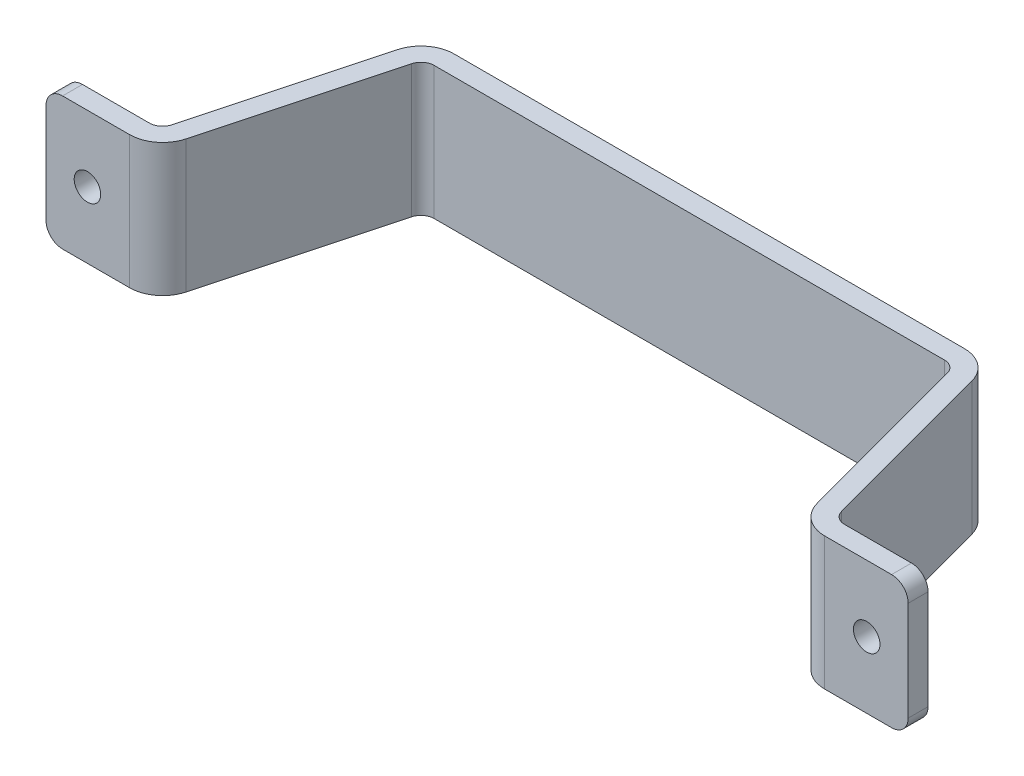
ISO-10303-21;
HEADER;
FILE_DESCRIPTION(('STEP AP214'),'2;1');
FILE_NAME('part.step','',(''),(''),'','','');
FILE_SCHEMA(('AUTOMOTIVE_DESIGN { 1 0 10303 214 1 1 1 1 }'));
ENDSEC;
DATA;
#1=APPLICATION_CONTEXT('core data for automotive mechanical design processes');
#2=APPLICATION_PROTOCOL_DEFINITION('international standard','automotive_design',2000,#1);
#3=PRODUCT_CONTEXT('',#1,'mechanical');
#4=PRODUCT('Part','Part','',(#3));
#5=PRODUCT_RELATED_PRODUCT_CATEGORY('part','',(#4));
#6=PRODUCT_DEFINITION_FORMATION('','',#4);
#7=PRODUCT_DEFINITION_CONTEXT('part definition',#1,'design');
#8=PRODUCT_DEFINITION('design','',#6,#7);
#9=PRODUCT_DEFINITION_SHAPE('','',#8);
#10=(LENGTH_UNIT() NAMED_UNIT(*) SI_UNIT(.MILLI.,.METRE.));
#11=(NAMED_UNIT(*) PLANE_ANGLE_UNIT() SI_UNIT($,.RADIAN.));
#12=(NAMED_UNIT(*) SI_UNIT($,.STERADIAN.) SOLID_ANGLE_UNIT());
#13=UNCERTAINTY_MEASURE_WITH_UNIT(LENGTH_MEASURE(1.E-05),#10,'distance_accuracy_value','');
#14=(GEOMETRIC_REPRESENTATION_CONTEXT(3) GLOBAL_UNCERTAINTY_ASSIGNED_CONTEXT((#13)) GLOBAL_UNIT_ASSIGNED_CONTEXT((#10,
#11,#12)) REPRESENTATION_CONTEXT('',''));
#15=CARTESIAN_POINT('',(0.,0.,0.));
#16=DIRECTION('',(0.,0.,1.));
#17=DIRECTION('',(1.,0.,0.));
#18=AXIS2_PLACEMENT_3D('',#15,#16,#17);
#19=CARTESIAN_POINT('',(12.5,15.,-3.00000000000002));
#20=DIRECTION('',(1.,0.,0.));
#21=DIRECTION('',(0.,0.,-1.));
#22=AXIS2_PLACEMENT_3D('',#19,#20,#21);
#23=PLANE('',#22);
#24=DIRECTION('',(0.,0.,-1.));
#25=VECTOR('',#24,1.);
#26=CARTESIAN_POINT('',(12.5,15.,-21.8590083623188));
#27=LINE('',#26,#25);
#28=CARTESIAN_POINT('',(12.5,15.,0.));
#29=VERTEX_POINT('',#28);
#30=CARTESIAN_POINT('',(12.5,15.,-6.00000000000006));
#31=VERTEX_POINT('',#30);
#32=EDGE_CURVE('E96',#29,#31,#27,.T.);
#33=ORIENTED_EDGE('',*,*,#32,.F.);
#34=DIRECTION('',(0.,1.,0.));
#35=VECTOR('',#34,1.);
#36=CARTESIAN_POINT('',(12.5,0.,0.));
#37=LINE('',#36,#35);
#38=CARTESIAN_POINT('',(12.5,-15.,0.));
#39=VERTEX_POINT('',#38);
#40=EDGE_CURVE('E214',#39,#29,#37,.T.);
#41=ORIENTED_EDGE('',*,*,#40,.F.);
#42=DIRECTION('',(0.,0.,-1.));
#43=VECTOR('',#42,1.);
#44=CARTESIAN_POINT('',(12.5,-15.,-21.8590083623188));
#45=LINE('',#44,#43);
#46=CARTESIAN_POINT('',(12.5,-15.,-6.00000000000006));
#47=VERTEX_POINT('',#46);
#48=EDGE_CURVE('E67',#47,#39,#45,.F.);
#49=ORIENTED_EDGE('',*,*,#48,.F.);
#50=DIRECTION('',(0.,1.,0.));
#51=VECTOR('',#50,1.);
#52=CARTESIAN_POINT('',(12.5,0.,-6.00000000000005));
#53=LINE('',#52,#51);
#54=EDGE_CURVE('E197',#31,#47,#53,.F.);
#55=ORIENTED_EDGE('',*,*,#54,.F.);
#56=EDGE_LOOP('',(#33,#41,#49,#55));
#57=FACE_BOUND('',#56,.T.);
#58=ADVANCED_FACE('F15',(#57),#23,.T.);
#59=CARTESIAN_POINT('',(0.,0.,-3.00000000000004));
#60=DIRECTION('',(0.,0.,1.));
#61=DIRECTION('',(0.,-1.,0.));
#62=AXIS2_PLACEMENT_3D('',#59,#60,#61);
#63=CYLINDRICAL_SURFACE('',#62,4.);
#64=CARTESIAN_POINT('',(0.,0.,0.));
#65=DIRECTION('',(0.,0.,1.));
#66=DIRECTION('',(0.,-1.,0.));
#67=AXIS2_PLACEMENT_3D('',#64,#65,#66);
#68=CIRCLE('',#67,4.);
#69=CARTESIAN_POINT('',(0.,-3.99999999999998,0.));
#70=VERTEX_POINT('',#69);
#71=EDGE_CURVE('E206',#70,#70,#68,.F.);
#72=ORIENTED_EDGE('',*,*,#71,.F.);
#73=EDGE_LOOP('',(#72));
#74=FACE_BOUND('',#73,.T.);
#75=CARTESIAN_POINT('',(0.,0.,-6.00000000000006));
#76=DIRECTION('',(0.,0.,1.));
#77=DIRECTION('',(0.,-1.,0.));
#78=AXIS2_PLACEMENT_3D('',#75,#76,#77);
#79=CIRCLE('',#78,4.);
#80=CARTESIAN_POINT('',(0.,-3.99999999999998,-6.00000000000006));
#81=VERTEX_POINT('',#80);
#82=EDGE_CURVE('E192',#81,#81,#79,.T.);
#83=ORIENTED_EDGE('',*,*,#82,.F.);
#84=EDGE_LOOP('',(#83));
#85=FACE_BOUND('',#84,.T.);
#86=ADVANCED_FACE('F715',(#74,#85),#63,.F.);
#87=CARTESIAN_POINT('',(-247.5,-20.0000000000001,0.));
#88=DIRECTION('',(-1.,0.,0.));
#89=DIRECTION('',(0.,0.,1.));
#90=AXIS2_PLACEMENT_3D('',#87,#88,#89);
#91=PLANE('',#90);
#92=DIRECTION('',(0.,0.,-1.));
#93=VECTOR('',#92,1.);
#94=CARTESIAN_POINT('',(-247.5,15.,-21.8590083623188));
#95=LINE('',#94,#93);
#96=CARTESIAN_POINT('',(-247.5,15.,-6.00000000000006));
#97=VERTEX_POINT('',#96);
#98=CARTESIAN_POINT('',(-247.5,15.,0.));
#99=VERTEX_POINT('',#98);
#100=EDGE_CURVE('E66',#97,#99,#95,.F.);
#101=ORIENTED_EDGE('',*,*,#100,.F.);
#102=DIRECTION('',(0.,1.,0.));
#103=VECTOR('',#102,1.);
#104=CARTESIAN_POINT('',(-247.5,-20.0000000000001,-6.00000000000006));
#105=LINE('',#104,#103);
#106=CARTESIAN_POINT('',(-247.5,-15.,-6.00000000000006));
#107=VERTEX_POINT('',#106);
#108=EDGE_CURVE('E62',#107,#97,#105,.T.);
#109=ORIENTED_EDGE('',*,*,#108,.F.);
#110=DIRECTION('',(0.,0.,-1.));
#111=VECTOR('',#110,1.);
#112=CARTESIAN_POINT('',(-247.5,-15.,-21.8590083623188));
#113=LINE('',#112,#111);
#114=CARTESIAN_POINT('',(-247.5,-15.,0.));
#115=VERTEX_POINT('',#114);
#116=EDGE_CURVE('E53',#115,#107,#113,.T.);
#117=ORIENTED_EDGE('',*,*,#116,.F.);
#118=DIRECTION('',(0.,1.,0.));
#119=VECTOR('',#118,1.);
#120=CARTESIAN_POINT('',(-247.5,-20.0000000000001,0.));
#121=LINE('',#120,#119);
#122=EDGE_CURVE('E58',#99,#115,#121,.F.);
#123=ORIENTED_EDGE('',*,*,#122,.F.);
#124=EDGE_LOOP('',(#101,#109,#117,#123));
#125=FACE_BOUND('',#124,.T.);
#126=ADVANCED_FACE('F56',(#125),#91,.T.);
#127=CARTESIAN_POINT('',(-235.,0.,86.4868739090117));
#128=DIRECTION('',(0.,0.,-1.));
#129=DIRECTION('',(-1.,0.,0.));
#130=AXIS2_PLACEMENT_3D('',#127,#128,#129);
#131=CYLINDRICAL_SURFACE('',#130,4.);
#132=CARTESIAN_POINT('',(-235.,0.,0.));
#133=DIRECTION('',(0.,0.,-1.));
#134=DIRECTION('',(-1.,0.,0.));
#135=AXIS2_PLACEMENT_3D('',#132,#133,#134);
#136=CIRCLE('',#135,4.);
#137=CARTESIAN_POINT('',(-235.,-4.,0.));
#138=VERTEX_POINT('',#137);
#139=EDGE_CURVE('E32',#138,#138,#136,.T.);
#140=ORIENTED_EDGE('',*,*,#139,.F.);
#141=EDGE_LOOP('',(#140));
#142=FACE_BOUND('',#141,.T.);
#143=CARTESIAN_POINT('',(-235.,0.,-6.00000000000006));
#144=DIRECTION('',(0.,0.,-1.));
#145=DIRECTION('',(-1.,0.,0.));
#146=AXIS2_PLACEMENT_3D('',#143,#144,#145);
#147=CIRCLE('',#146,4.);
#148=CARTESIAN_POINT('',(-235.,-4.,-6.00000000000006));
#149=VERTEX_POINT('',#148);
#150=EDGE_CURVE('E181',#149,#149,#147,.F.);
#151=ORIENTED_EDGE('',*,*,#150,.F.);
#152=EDGE_LOOP('',(#151));
#153=FACE_BOUND('',#152,.T.);
#154=ADVANCED_FACE('F702',(#142,#153),#131,.F.);
#155=CARTESIAN_POINT('',(7.5,-15.,-21.8590083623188));
#156=DIRECTION('',(0.,0.,-1.));
#157=DIRECTION('',(-1.,0.,0.));
#158=AXIS2_PLACEMENT_3D('',#155,#156,#157);
#159=CYLINDRICAL_SURFACE('',#158,5.);
#160=CARTESIAN_POINT('',(7.5,-15.,0.));
#161=DIRECTION('',(0.,0.,-1.));
#162=DIRECTION('',(-1.,0.,0.));
#163=AXIS2_PLACEMENT_3D('',#160,#161,#162);
#164=CIRCLE('',#163,5.);
#165=CARTESIAN_POINT('',(7.5,-20.0000000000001,0.));
#166=VERTEX_POINT('',#165);
#167=EDGE_CURVE('E211',#166,#39,#164,.F.);
#168=ORIENTED_EDGE('',*,*,#167,.F.);
#169=DIRECTION('',(0.,0.,1.));
#170=VECTOR('',#169,1.);
#171=CARTESIAN_POINT('',(7.5,-20.0000000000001,-35.0000000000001));
#172=LINE('',#171,#170);
#173=CARTESIAN_POINT('',(7.5,-20.0000000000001,-6.00000000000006));
#174=VERTEX_POINT('',#173);
#175=EDGE_CURVE('E89',#166,#174,#172,.F.);
#176=ORIENTED_EDGE('',*,*,#175,.T.);
#177=CARTESIAN_POINT('',(7.5,-15.,-6.00000000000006));
#178=DIRECTION('',(0.,0.,-1.));
#179=DIRECTION('',(-1.,0.,0.));
#180=AXIS2_PLACEMENT_3D('',#177,#178,#179);
#181=CIRCLE('',#180,5.);
#182=EDGE_CURVE('E99',#47,#174,#181,.T.);
#183=ORIENTED_EDGE('',*,*,#182,.F.);
#184=ORIENTED_EDGE('',*,*,#48,.T.);
#185=EDGE_LOOP('',(#168,#176,#183,#184));
#186=FACE_BOUND('',#185,.T.);
#187=ADVANCED_FACE('F463',(#186),#159,.T.);
#188=CARTESIAN_POINT('',(-242.5,-15.,-21.8590083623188));
#189=DIRECTION('',(0.,0.,-1.));
#190=DIRECTION('',(-1.,0.,0.));
#191=AXIS2_PLACEMENT_3D('',#188,#189,#190);
#192=CYLINDRICAL_SURFACE('',#191,5.);
#193=CARTESIAN_POINT('',(-242.5,-15.,0.));
#194=DIRECTION('',(0.,0.,-1.));
#195=DIRECTION('',(-1.,0.,0.));
#196=AXIS2_PLACEMENT_3D('',#193,#194,#195);
#197=CIRCLE('',#196,5.);
#198=CARTESIAN_POINT('',(-242.5,-20.0000000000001,0.));
#199=VERTEX_POINT('',#198);
#200=EDGE_CURVE('E18',#115,#199,#197,.F.);
#201=ORIENTED_EDGE('',*,*,#200,.F.);
#202=ORIENTED_EDGE('',*,*,#116,.T.);
#203=CARTESIAN_POINT('',(-242.5,-15.,-6.00000000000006));
#204=DIRECTION('',(0.,0.,-1.));
#205=DIRECTION('',(-1.,0.,0.));
#206=AXIS2_PLACEMENT_3D('',#203,#204,#205);
#207=CIRCLE('',#206,5.);
#208=CARTESIAN_POINT('',(-242.5,-20.0000000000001,-6.00000000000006));
#209=VERTEX_POINT('',#208);
#210=EDGE_CURVE('E189',#209,#107,#207,.T.);
#211=ORIENTED_EDGE('',*,*,#210,.F.);
#212=DIRECTION('',(0.,0.,1.));
#213=VECTOR('',#212,1.);
#214=CARTESIAN_POINT('',(-242.5,-20.0000000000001,-35.0000000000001));
#215=LINE('',#214,#213);
#216=EDGE_CURVE('E73',#209,#199,#215,.T.);
#217=ORIENTED_EDGE('',*,*,#216,.T.);
#218=EDGE_LOOP('',(#201,#202,#211,#217));
#219=FACE_BOUND('',#218,.T.);
#220=ADVANCED_FACE('F71',(#219),#192,.T.);
#221=CARTESIAN_POINT('',(-242.5,15.,-21.8590083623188));
#222=DIRECTION('',(0.,0.,-1.));
#223=DIRECTION('',(-1.,0.,0.));
#224=AXIS2_PLACEMENT_3D('',#221,#222,#223);
#225=CYLINDRICAL_SURFACE('',#224,5.);
#226=CARTESIAN_POINT('',(-242.5,15.,0.));
#227=DIRECTION('',(0.,0.,-1.));
#228=DIRECTION('',(-1.,0.,0.));
#229=AXIS2_PLACEMENT_3D('',#226,#227,#228);
#230=CIRCLE('',#229,5.);
#231=CARTESIAN_POINT('',(-242.5,20.,0.));
#232=VERTEX_POINT('',#231);
#233=EDGE_CURVE('E77',#232,#99,#230,.F.);
#234=ORIENTED_EDGE('',*,*,#233,.F.);
#235=DIRECTION('',(0.,0.,1.));
#236=VECTOR('',#235,1.);
#237=CARTESIAN_POINT('',(-242.5,20.,-35.0000000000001));
#238=LINE('',#237,#236);
#239=CARTESIAN_POINT('',(-242.5,20.,-6.00000000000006));
#240=VERTEX_POINT('',#239);
#241=EDGE_CURVE('E154',#240,#232,#238,.T.);
#242=ORIENTED_EDGE('',*,*,#241,.F.);
#243=CARTESIAN_POINT('',(-242.5,15.,-6.00000000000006));
#244=DIRECTION('',(0.,0.,-1.));
#245=DIRECTION('',(-1.,0.,0.));
#246=AXIS2_PLACEMENT_3D('',#243,#244,#245);
#247=CIRCLE('',#246,5.);
#248=EDGE_CURVE('E186',#97,#240,#247,.T.);
#249=ORIENTED_EDGE('',*,*,#248,.F.);
#250=ORIENTED_EDGE('',*,*,#100,.T.);
#251=EDGE_LOOP('',(#234,#242,#249,#250));
#252=FACE_BOUND('',#251,.T.);
#253=ADVANCED_FACE('F528',(#252),#225,.T.);
#254=CARTESIAN_POINT('',(-222.322018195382,-20.0000000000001,0.));
#255=DIRECTION('',(0.,0.,1.));
#256=DIRECTION('',(1.,0.,0.));
#257=AXIS2_PLACEMENT_3D('',#254,#255,#256);
#258=PLANE('',#257);
#259=ORIENTED_EDGE('',*,*,#139,.T.);
#260=EDGE_LOOP('',(#259));
#261=FACE_BOUND('',#260,.T.);
#262=ORIENTED_EDGE('',*,*,#233,.T.);
#263=ORIENTED_EDGE('',*,*,#122,.T.);
#264=ORIENTED_EDGE('',*,*,#200,.T.);
#265=DIRECTION('',(1.,0.,0.));
#266=VECTOR('',#265,1.);
#267=CARTESIAN_POINT('',(7.5,-20.0000000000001,0.));
#268=LINE('',#267,#266);
#269=CARTESIAN_POINT('',(-222.322018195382,-20.0000000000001,0.));
#270=VERTEX_POINT('',#269);
#271=EDGE_CURVE('E180',#199,#270,#268,.T.);
#272=ORIENTED_EDGE('',*,*,#271,.T.);
#273=DIRECTION('',(0.,1.,0.));
#274=VECTOR('',#273,1.);
#275=CARTESIAN_POINT('',(-222.322018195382,-20.0000000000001,0.));
#276=LINE('',#275,#274);
#277=CARTESIAN_POINT('',(-222.322018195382,20.,0.));
#278=VERTEX_POINT('',#277);
#279=EDGE_CURVE('E81',#278,#270,#276,.F.);
#280=ORIENTED_EDGE('',*,*,#279,.F.);
#281=DIRECTION('',(1.,0.,0.));
#282=VECTOR('',#281,1.);
#283=CARTESIAN_POINT('',(7.5,20.,0.));
#284=LINE('',#283,#282);
#285=EDGE_CURVE('E149',#232,#278,#284,.T.);
#286=ORIENTED_EDGE('',*,*,#285,.F.);
#287=EDGE_LOOP('',(#262,#263,#264,#272,#280,#286));
#288=FACE_BOUND('',#287,.T.);
#289=ADVANCED_FACE('F78',(#261,#288),#258,.T.);
#290=CARTESIAN_POINT('',(-222.322018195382,-20.0000000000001,-10.0000000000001));
#291=DIRECTION('',(0.,1.,0.));
#292=DIRECTION('',(0.,0.,1.));
#293=AXIS2_PLACEMENT_3D('',#290,#291,#292);
#294=CYLINDRICAL_SURFACE('',#293,10.);
#295=CARTESIAN_POINT('',(-222.322018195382,-20.0000000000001,-10.0000000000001));
#296=DIRECTION('',(0.,1.,0.));
#297=DIRECTION('',(0.,0.,1.));
#298=AXIS2_PLACEMENT_3D('',#295,#296,#297);
#299=CIRCLE('',#298,10.);
#300=CARTESIAN_POINT('',(-212.662759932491,-20.0000000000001,-7.4118095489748));
#301=VERTEX_POINT('',#300);
#302=EDGE_CURVE('E176',#270,#301,#299,.T.);
#303=ORIENTED_EDGE('',*,*,#302,.T.);
#304=DIRECTION('',(0.,1.,0.));
#305=VECTOR('',#304,1.);
#306=CARTESIAN_POINT('',(-212.662759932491,-20.,-7.41180954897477));
#307=LINE('',#306,#305);
#308=CARTESIAN_POINT('',(-212.662759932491,20.,-7.4118095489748));
#309=VERTEX_POINT('',#308);
#310=EDGE_CURVE('E184',#309,#301,#307,.F.);
#311=ORIENTED_EDGE('',*,*,#310,.F.);
#312=CARTESIAN_POINT('',(-222.322018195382,20.,-10.0000000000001));
#313=DIRECTION('',(0.,1.,0.));
#314=DIRECTION('',(0.,0.,1.));
#315=AXIS2_PLACEMENT_3D('',#312,#313,#314);
#316=CIRCLE('',#315,10.);
#317=EDGE_CURVE('E145',#278,#309,#316,.T.);
#318=ORIENTED_EDGE('',*,*,#317,.F.);
#319=ORIENTED_EDGE('',*,*,#279,.T.);
#320=EDGE_LOOP('',(#303,#311,#318,#319));
#321=FACE_BOUND('',#320,.T.);
#322=ADVANCED_FACE('F531',(#321),#294,.T.);
#323=CARTESIAN_POINT('',(-29.5214223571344,20.,-34.2235428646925));
#324=DIRECTION('',(-0.965925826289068,0.,0.25881904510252));
#325=DIRECTION('',(0.25881904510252,0.,0.965925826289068));
#326=AXIS2_PLACEMENT_3D('',#323,#324,#325);
#327=PLANE('',#326);
#328=DIRECTION('',(0.258819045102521,0.,0.965925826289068));
#329=VECTOR('',#328,1.);
#330=CARTESIAN_POINT('',(-36.7056046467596,-20.0000000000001,-61.0352761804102));
#331=LINE('',#330,#329);
#332=CARTESIAN_POINT('',(-36.7056046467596,-20.,-61.0352761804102));
#333=VERTEX_POINT('',#332);
#334=CARTESIAN_POINT('',(-22.3372400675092,-20.0000000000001,-7.41180954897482));
#335=VERTEX_POINT('',#334);
#336=EDGE_CURVE('E175',#333,#335,#331,.T.);
#337=ORIENTED_EDGE('',*,*,#336,.T.);
#338=DIRECTION('',(0.,-1.,0.));
#339=VECTOR('',#338,1.);
#340=CARTESIAN_POINT('',(-22.3372400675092,0.,-7.4118095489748));
#341=LINE('',#340,#339);
#342=CARTESIAN_POINT('',(-22.3372400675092,20.,-7.41180954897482));
#343=VERTEX_POINT('',#342);
#344=EDGE_CURVE('E215',#343,#335,#341,.T.);
#345=ORIENTED_EDGE('',*,*,#344,.F.);
#346=DIRECTION('',(0.258819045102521,0.,0.965925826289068));
#347=VECTOR('',#346,1.);
#348=CARTESIAN_POINT('',(-36.7056046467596,20.,-61.0352761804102));
#349=LINE('',#348,#347);
#350=CARTESIAN_POINT('',(-36.7056046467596,20.,-61.0352761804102));
#351=VERTEX_POINT('',#350);
#352=EDGE_CURVE('E139',#351,#343,#349,.T.);
#353=ORIENTED_EDGE('',*,*,#352,.F.);
#354=DIRECTION('',(0.,-1.,0.));
#355=VECTOR('',#354,1.);
#356=CARTESIAN_POINT('',(-36.7056046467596,0.,-61.0352761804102));
#357=LINE('',#356,#355);
#358=EDGE_CURVE('E87',#351,#333,#357,.T.);
#359=ORIENTED_EDGE('',*,*,#358,.T.);
#360=EDGE_LOOP('',(#337,#345,#353,#359));
#361=FACE_BOUND('',#360,.T.);
#362=ADVANCED_FACE('F533',(#361),#327,.T.);
#363=CARTESIAN_POINT('',(-12.6779818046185,0.,-10.));
#364=DIRECTION('',(0.,-1.,0.));
#365=DIRECTION('',(0.,0.,-1.));
#366=AXIS2_PLACEMENT_3D('',#363,#364,#365);
#367=CYLINDRICAL_SURFACE('',#366,10.);
#368=CARTESIAN_POINT('',(-12.6779818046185,-20.0000000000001,-10.));
#369=DIRECTION('',(0.,-1.,0.));
#370=DIRECTION('',(0.,0.,-1.));
#371=AXIS2_PLACEMENT_3D('',#368,#369,#370);
#372=CIRCLE('',#371,10.);
#373=CARTESIAN_POINT('',(-12.6779818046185,-20.0000000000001,0.));
#374=VERTEX_POINT('',#373);
#375=EDGE_CURVE('E172',#335,#374,#372,.F.);
#376=ORIENTED_EDGE('',*,*,#375,.T.);
#377=DIRECTION('',(0.,1.,0.));
#378=VECTOR('',#377,1.);
#379=CARTESIAN_POINT('',(-12.6779818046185,0.,0.));
#380=LINE('',#379,#378);
#381=CARTESIAN_POINT('',(-12.6779818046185,20.,0.));
#382=VERTEX_POINT('',#381);
#383=EDGE_CURVE('E210',#382,#374,#380,.F.);
#384=ORIENTED_EDGE('',*,*,#383,.F.);
#385=CARTESIAN_POINT('',(-12.6779818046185,20.,-10.));
#386=DIRECTION('',(0.,-1.,0.));
#387=DIRECTION('',(0.,0.,-1.));
#388=AXIS2_PLACEMENT_3D('',#385,#386,#387);
#389=CIRCLE('',#388,10.);
#390=EDGE_CURVE('E134',#343,#382,#389,.F.);
#391=ORIENTED_EDGE('',*,*,#390,.F.);
#392=ORIENTED_EDGE('',*,*,#344,.T.);
#393=EDGE_LOOP('',(#376,#384,#391,#392));
#394=FACE_BOUND('',#393,.T.);
#395=ADVANCED_FACE('F488',(#394),#367,.T.);
#396=CARTESIAN_POINT('',(12.5,0.,0.));
#397=DIRECTION('',(0.,0.,1.));
#398=DIRECTION('',(1.,0.,0.));
#399=AXIS2_PLACEMENT_3D('',#396,#397,#398);
#400=PLANE('',#399);
#401=ORIENTED_EDGE('',*,*,#71,.T.);
#402=EDGE_LOOP('',(#401));
#403=FACE_BOUND('',#402,.T.);
#404=ORIENTED_EDGE('',*,*,#383,.T.);
#405=DIRECTION('',(1.,0.,0.));
#406=VECTOR('',#405,1.);
#407=CARTESIAN_POINT('',(7.5,-20.0000000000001,0.));
#408=LINE('',#407,#406);
#409=EDGE_CURVE('E94',#374,#166,#408,.T.);
#410=ORIENTED_EDGE('',*,*,#409,.T.);
#411=ORIENTED_EDGE('',*,*,#167,.T.);
#412=ORIENTED_EDGE('',*,*,#40,.T.);
#413=CARTESIAN_POINT('',(7.5,15.,0.));
#414=DIRECTION('',(0.,0.,-1.));
#415=DIRECTION('',(-1.,0.,0.));
#416=AXIS2_PLACEMENT_3D('',#413,#414,#415);
#417=CIRCLE('',#416,5.);
#418=CARTESIAN_POINT('',(7.5,20.,0.));
#419=VERTEX_POINT('',#418);
#420=EDGE_CURVE('E100',#419,#29,#417,.T.);
#421=ORIENTED_EDGE('',*,*,#420,.F.);
#422=DIRECTION('',(1.,0.,0.));
#423=VECTOR('',#422,1.);
#424=CARTESIAN_POINT('',(7.5,20.,0.));
#425=LINE('',#424,#423);
#426=EDGE_CURVE('E138',#382,#419,#425,.T.);
#427=ORIENTED_EDGE('',*,*,#426,.F.);
#428=EDGE_LOOP('',(#404,#410,#411,#412,#421,#427));
#429=FACE_BOUND('',#428,.T.);
#430=ADVANCED_FACE('F469',(#403,#429),#400,.T.);
#431=CARTESIAN_POINT('',(7.5,15.,-21.8590083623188));
#432=DIRECTION('',(0.,0.,-1.));
#433=DIRECTION('',(-1.,0.,0.));
#434=AXIS2_PLACEMENT_3D('',#431,#432,#433);
#435=CYLINDRICAL_SURFACE('',#434,5.);
#436=ORIENTED_EDGE('',*,*,#420,.T.);
#437=ORIENTED_EDGE('',*,*,#32,.T.);
#438=CARTESIAN_POINT('',(7.5,15.,-6.00000000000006));
#439=DIRECTION('',(0.,0.,-1.));
#440=DIRECTION('',(-1.,0.,0.));
#441=AXIS2_PLACEMENT_3D('',#438,#439,#440);
#442=CIRCLE('',#441,5.);
#443=CARTESIAN_POINT('',(7.5,20.,-6.00000000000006));
#444=VERTEX_POINT('',#443);
#445=EDGE_CURVE('E198',#444,#31,#442,.T.);
#446=ORIENTED_EDGE('',*,*,#445,.F.);
#447=DIRECTION('',(0.,0.,1.));
#448=VECTOR('',#447,1.);
#449=CARTESIAN_POINT('',(7.5,20.,-35.0000000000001));
#450=LINE('',#449,#448);
#451=EDGE_CURVE('E283',#419,#444,#450,.F.);
#452=ORIENTED_EDGE('',*,*,#451,.F.);
#453=EDGE_LOOP('',(#436,#437,#446,#452));
#454=FACE_BOUND('',#453,.T.);
#455=ADVANCED_FACE('F484',(#454),#435,.T.);
#456=CARTESIAN_POINT('',(12.5,0.,-6.00000000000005));
#457=DIRECTION('',(0.,0.,-1.));
#458=DIRECTION('',(-1.,0.,0.));
#459=AXIS2_PLACEMENT_3D('',#456,#457,#458);
#460=PLANE('',#459);
#461=ORIENTED_EDGE('',*,*,#82,.T.);
#462=EDGE_LOOP('',(#461));
#463=FACE_BOUND('',#462,.T.);
#464=ORIENTED_EDGE('',*,*,#445,.T.);
#465=ORIENTED_EDGE('',*,*,#54,.T.);
#466=ORIENTED_EDGE('',*,*,#182,.T.);
#467=DIRECTION('',(1.,0.,0.));
#468=VECTOR('',#467,1.);
#469=CARTESIAN_POINT('',(7.5,-20.0000000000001,-6.00000000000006));
#470=LINE('',#469,#468);
#471=CARTESIAN_POINT('',(-12.6779818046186,-20.0000000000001,-6.00000000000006));
#472=VERTEX_POINT('',#471);
#473=EDGE_CURVE('E93',#174,#472,#470,.F.);
#474=ORIENTED_EDGE('',*,*,#473,.T.);
#475=DIRECTION('',(0.,-1.,0.));
#476=VECTOR('',#475,1.);
#477=CARTESIAN_POINT('',(-12.6779818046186,0.,-6.00000000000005));
#478=LINE('',#477,#476);
#479=CARTESIAN_POINT('',(-12.6779818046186,20.,-6.00000000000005));
#480=VERTEX_POINT('',#479);
#481=EDGE_CURVE('E196',#472,#480,#478,.F.);
#482=ORIENTED_EDGE('',*,*,#481,.T.);
#483=DIRECTION('',(1.,0.,0.));
#484=VECTOR('',#483,1.);
#485=CARTESIAN_POINT('',(7.5,20.,-6.00000000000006));
#486=LINE('',#485,#484);
#487=EDGE_CURVE('E133',#444,#480,#486,.F.);
#488=ORIENTED_EDGE('',*,*,#487,.F.);
#489=EDGE_LOOP('',(#464,#465,#466,#474,#482,#488));
#490=FACE_BOUND('',#489,.T.);
#491=ADVANCED_FACE('F475',(#463,#490),#460,.T.);
#492=CARTESIAN_POINT('',(-12.6779818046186,0.,-10.0000000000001));
#493=DIRECTION('',(0.,-1.,0.));
#494=DIRECTION('',(0.,0.,-1.));
#495=AXIS2_PLACEMENT_3D('',#492,#493,#494);
#496=CYLINDRICAL_SURFACE('',#495,4.);
#497=ORIENTED_EDGE('',*,*,#481,.F.);
#498=CARTESIAN_POINT('',(-12.6779818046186,-20.0000000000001,-10.0000000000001));
#499=DIRECTION('',(0.,-1.,0.));
#500=DIRECTION('',(0.,0.,-1.));
#501=AXIS2_PLACEMENT_3D('',#498,#499,#500);
#502=CIRCLE('',#501,4.);
#503=CARTESIAN_POINT('',(-16.5416851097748,-20.0000000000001,-8.96472381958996));
#504=VERTEX_POINT('',#503);
#505=EDGE_CURVE('E169',#472,#504,#502,.T.);
#506=ORIENTED_EDGE('',*,*,#505,.T.);
#507=DIRECTION('',(0.,1.,0.));
#508=VECTOR('',#507,1.);
#509=CARTESIAN_POINT('',(-16.5416851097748,20.,-8.96472381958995));
#510=LINE('',#509,#508);
#511=CARTESIAN_POINT('',(-16.5416851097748,20.,-8.96472381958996));
#512=VERTEX_POINT('',#511);
#513=EDGE_CURVE('E275',#512,#504,#510,.F.);
#514=ORIENTED_EDGE('',*,*,#513,.F.);
#515=CARTESIAN_POINT('',(-12.6779818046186,20.,-10.));
#516=DIRECTION('',(0.,-1.,0.));
#517=DIRECTION('',(0.,0.,-1.));
#518=AXIS2_PLACEMENT_3D('',#515,#516,#517);
#519=CIRCLE('',#518,4.);
#520=EDGE_CURVE('E129',#480,#512,#519,.T.);
#521=ORIENTED_EDGE('',*,*,#520,.F.);
#522=EDGE_LOOP('',(#497,#506,#514,#521));
#523=FACE_BOUND('',#522,.T.);
#524=ADVANCED_FACE('F479',(#523),#496,.F.);
#525=CARTESIAN_POINT('',(-23.7258673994,20.,-35.7764571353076));
#526=DIRECTION('',(0.965925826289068,0.,-0.258819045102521));
#527=DIRECTION('',(-0.258819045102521,0.,-0.965925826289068));
#528=AXIS2_PLACEMENT_3D('',#525,#526,#527);
#529=PLANE('',#528);
#530=DIRECTION('',(-0.258819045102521,0.,-0.965925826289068));
#531=VECTOR('',#530,1.);
#532=CARTESIAN_POINT('',(-16.5416851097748,-20.0000000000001,-8.96472381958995));
#533=LINE('',#532,#531);
#534=CARTESIAN_POINT('',(-30.9100496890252,-20.,-62.5881904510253));
#535=VERTEX_POINT('',#534);
#536=EDGE_CURVE('E168',#504,#535,#533,.T.);
#537=ORIENTED_EDGE('',*,*,#536,.T.);
#538=DIRECTION('',(0.,-1.,0.));
#539=VECTOR('',#538,1.);
#540=CARTESIAN_POINT('',(-30.9100496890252,0.,-62.5881904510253));
#541=LINE('',#540,#539);
#542=CARTESIAN_POINT('',(-30.9100496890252,20.,-62.5881904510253));
#543=VERTEX_POINT('',#542);
#544=EDGE_CURVE('E271',#543,#535,#541,.T.);
#545=ORIENTED_EDGE('',*,*,#544,.F.);
#546=DIRECTION('',(-0.258819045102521,0.,-0.965925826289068));
#547=VECTOR('',#546,1.);
#548=CARTESIAN_POINT('',(-16.5416851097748,20.,-8.96472381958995));
#549=LINE('',#548,#547);
#550=EDGE_CURVE('E128',#512,#543,#549,.T.);
#551=ORIENTED_EDGE('',*,*,#550,.F.);
#552=ORIENTED_EDGE('',*,*,#513,.T.);
#553=EDGE_LOOP('',(#537,#545,#551,#552));
#554=FACE_BOUND('',#553,.T.);
#555=ADVANCED_FACE('F502',(#554),#529,.T.);
#556=CARTESIAN_POINT('',(-40.5693079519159,0.,-60.0000000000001));
#557=DIRECTION('',(0.,-1.,0.));
#558=DIRECTION('',(0.,0.,-1.));
#559=AXIS2_PLACEMENT_3D('',#556,#557,#558);
#560=CYLINDRICAL_SURFACE('',#559,9.99999999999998);
#561=CARTESIAN_POINT('',(-40.5693079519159,-20.,-60.0000000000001));
#562=DIRECTION('',(0.,-1.,0.));
#563=DIRECTION('',(0.,0.,-1.));
#564=AXIS2_PLACEMENT_3D('',#561,#562,#563);
#565=CIRCLE('',#564,9.99999999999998);
#566=CARTESIAN_POINT('',(-40.5693079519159,-20.,-70.0000000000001));
#567=VERTEX_POINT('',#566);
#568=EDGE_CURVE('E164',#535,#567,#565,.F.);
#569=ORIENTED_EDGE('',*,*,#568,.T.);
#570=DIRECTION('',(0.,1.,0.));
#571=VECTOR('',#570,1.);
#572=CARTESIAN_POINT('',(-40.5693079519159,0.,-70.0000000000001));
#573=LINE('',#572,#571);
#574=CARTESIAN_POINT('',(-40.5693079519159,20.,-70.0000000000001));
#575=VERTEX_POINT('',#574);
#576=EDGE_CURVE('E267',#575,#567,#573,.F.);
#577=ORIENTED_EDGE('',*,*,#576,.F.);
#578=CARTESIAN_POINT('',(-40.5693079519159,20.,-60.0000000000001));
#579=DIRECTION('',(0.,-1.,0.));
#580=DIRECTION('',(0.,0.,-1.));
#581=AXIS2_PLACEMENT_3D('',#578,#579,#580);
#582=CIRCLE('',#581,9.99999999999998);
#583=EDGE_CURVE('E124',#543,#575,#582,.F.);
#584=ORIENTED_EDGE('',*,*,#583,.F.);
#585=ORIENTED_EDGE('',*,*,#544,.T.);
#586=EDGE_LOOP('',(#569,#577,#584,#585));
#587=FACE_BOUND('',#586,.T.);
#588=ADVANCED_FACE('F505',(#587),#560,.T.);
#589=CARTESIAN_POINT('',(-40.5693079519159,0.,-70.0000000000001));
#590=DIRECTION('',(0.,0.,-1.));
#591=DIRECTION('',(-1.,0.,0.));
#592=AXIS2_PLACEMENT_3D('',#589,#590,#591);
#593=PLANE('',#592);
#594=DIRECTION('',(1.,0.,0.));
#595=VECTOR('',#594,1.);
#596=CARTESIAN_POINT('',(7.5,-20.0000000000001,-70.0000000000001));
#597=LINE('',#596,#595);
#598=CARTESIAN_POINT('',(-194.430692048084,-20.,-70.0000000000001));
#599=VERTEX_POINT('',#598);
#600=EDGE_CURVE('E163',#567,#599,#597,.F.);
#601=ORIENTED_EDGE('',*,*,#600,.T.);
#602=DIRECTION('',(0.,1.,0.));
#603=VECTOR('',#602,1.);
#604=CARTESIAN_POINT('',(-194.430692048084,-20.,-70.0000000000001));
#605=LINE('',#604,#603);
#606=CARTESIAN_POINT('',(-194.430692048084,20.,-70.0000000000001));
#607=VERTEX_POINT('',#606);
#608=EDGE_CURVE('E263',#607,#599,#605,.F.);
#609=ORIENTED_EDGE('',*,*,#608,.F.);
#610=DIRECTION('',(1.,0.,0.));
#611=VECTOR('',#610,1.);
#612=CARTESIAN_POINT('',(7.5,20.,-70.0000000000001));
#613=LINE('',#612,#611);
#614=EDGE_CURVE('E123',#575,#607,#613,.F.);
#615=ORIENTED_EDGE('',*,*,#614,.F.);
#616=ORIENTED_EDGE('',*,*,#576,.T.);
#617=EDGE_LOOP('',(#601,#609,#615,#616));
#618=FACE_BOUND('',#617,.T.);
#619=ADVANCED_FACE('F509',(#618),#593,.T.);
#620=CARTESIAN_POINT('',(-194.430692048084,-20.,-60.0000000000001));
#621=DIRECTION('',(0.,1.,0.));
#622=DIRECTION('',(0.,0.,1.));
#623=AXIS2_PLACEMENT_3D('',#620,#621,#622);
#624=CYLINDRICAL_SURFACE('',#623,10.);
#625=CARTESIAN_POINT('',(-194.430692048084,-20.,-60.0000000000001));
#626=DIRECTION('',(0.,1.,0.));
#627=DIRECTION('',(0.,0.,1.));
#628=AXIS2_PLACEMENT_3D('',#625,#626,#627);
#629=CIRCLE('',#628,10.);
#630=CARTESIAN_POINT('',(-204.089950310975,-20.,-62.5881904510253));
#631=VERTEX_POINT('',#630);
#632=EDGE_CURVE('E159',#599,#631,#629,.T.);
#633=ORIENTED_EDGE('',*,*,#632,.T.);
#634=DIRECTION('',(0.,1.,0.));
#635=VECTOR('',#634,1.);
#636=CARTESIAN_POINT('',(-204.089950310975,-20.0000000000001,-62.5881904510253));
#637=LINE('',#636,#635);
#638=CARTESIAN_POINT('',(-204.089950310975,20.,-62.5881904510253));
#639=VERTEX_POINT('',#638);
#640=EDGE_CURVE('E259',#639,#631,#637,.F.);
#641=ORIENTED_EDGE('',*,*,#640,.F.);
#642=CARTESIAN_POINT('',(-194.430692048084,20.,-60.0000000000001));
#643=DIRECTION('',(0.,1.,0.));
#644=DIRECTION('',(0.,0.,1.));
#645=AXIS2_PLACEMENT_3D('',#642,#643,#644);
#646=CIRCLE('',#645,10.);
#647=EDGE_CURVE('E119',#607,#639,#646,.T.);
#648=ORIENTED_EDGE('',*,*,#647,.F.);
#649=ORIENTED_EDGE('',*,*,#608,.T.);
#650=EDGE_LOOP('',(#633,#641,#648,#649));
#651=FACE_BOUND('',#650,.T.);
#652=ADVANCED_FACE('F512',(#651),#624,.T.);
#653=CARTESIAN_POINT('',(-218.458314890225,-20.0000000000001,-8.96472381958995));
#654=DIRECTION('',(-0.965925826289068,0.,-0.258819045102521));
#655=DIRECTION('',(-0.258819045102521,0.,0.965925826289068));
#656=AXIS2_PLACEMENT_3D('',#653,#654,#655);
#657=PLANE('',#656);
#658=DIRECTION('',(-0.25881904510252,0.,0.965925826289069));
#659=VECTOR('',#658,1.);
#660=CARTESIAN_POINT('',(-204.089950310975,-20.0000000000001,-62.5881904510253));
#661=LINE('',#660,#659);
#662=CARTESIAN_POINT('',(-218.458314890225,-20.0000000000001,-8.96472381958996));
#663=VERTEX_POINT('',#662);
#664=EDGE_CURVE('E158',#631,#663,#661,.T.);
#665=ORIENTED_EDGE('',*,*,#664,.T.);
#666=DIRECTION('',(0.,1.,0.));
#667=VECTOR('',#666,1.);
#668=CARTESIAN_POINT('',(-218.458314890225,-20.0000000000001,-8.96472381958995));
#669=LINE('',#668,#667);
#670=CARTESIAN_POINT('',(-218.458314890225,20.,-8.96472381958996));
#671=VERTEX_POINT('',#670);
#672=EDGE_CURVE('E191',#663,#671,#669,.T.);
#673=ORIENTED_EDGE('',*,*,#672,.T.);
#674=DIRECTION('',(-0.25881904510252,0.,0.965925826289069));
#675=VECTOR('',#674,1.);
#676=CARTESIAN_POINT('',(-204.089950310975,20.,-62.5881904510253));
#677=LINE('',#676,#675);
#678=EDGE_CURVE('E118',#639,#671,#677,.T.);
#679=ORIENTED_EDGE('',*,*,#678,.F.);
#680=ORIENTED_EDGE('',*,*,#640,.T.);
#681=EDGE_LOOP('',(#665,#673,#679,#680));
#682=FACE_BOUND('',#681,.T.);
#683=ADVANCED_FACE('F516',(#682),#657,.T.);
#684=CARTESIAN_POINT('',(-222.322018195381,-20.0000000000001,-10.0000000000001));
#685=DIRECTION('',(0.,1.,0.));
#686=DIRECTION('',(0.,0.,1.));
#687=AXIS2_PLACEMENT_3D('',#684,#685,#686);
#688=CYLINDRICAL_SURFACE('',#687,4.);
#689=ORIENTED_EDGE('',*,*,#672,.F.);
#690=CARTESIAN_POINT('',(-222.322018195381,-20.0000000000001,-10.0000000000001));
#691=DIRECTION('',(0.,1.,0.));
#692=DIRECTION('',(0.,0.,1.));
#693=AXIS2_PLACEMENT_3D('',#690,#691,#692);
#694=CIRCLE('',#693,4.);
#695=CARTESIAN_POINT('',(-222.322018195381,-20.0000000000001,-6.00000000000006));
#696=VERTEX_POINT('',#695);
#697=EDGE_CURVE('E155',#663,#696,#694,.F.);
#698=ORIENTED_EDGE('',*,*,#697,.T.);
#699=DIRECTION('',(0.,1.,0.));
#700=VECTOR('',#699,1.);
#701=CARTESIAN_POINT('',(-222.322018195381,-20.0000000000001,-6.00000000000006));
#702=LINE('',#701,#700);
#703=CARTESIAN_POINT('',(-222.322018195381,20.,-6.00000000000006));
#704=VERTEX_POINT('',#703);
#705=EDGE_CURVE('E185',#704,#696,#702,.F.);
#706=ORIENTED_EDGE('',*,*,#705,.F.);
#707=CARTESIAN_POINT('',(-222.322018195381,20.,-10.0000000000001));
#708=DIRECTION('',(0.,1.,0.));
#709=DIRECTION('',(0.,0.,1.));
#710=AXIS2_PLACEMENT_3D('',#707,#708,#709);
#711=CIRCLE('',#710,4.);
#712=EDGE_CURVE('E114',#671,#704,#711,.F.);
#713=ORIENTED_EDGE('',*,*,#712,.F.);
#714=EDGE_LOOP('',(#689,#698,#706,#713));
#715=FACE_BOUND('',#714,.T.);
#716=ADVANCED_FACE('F521',(#715),#688,.F.);
#717=CARTESIAN_POINT('',(-247.5,-20.0000000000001,-6.00000000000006));
#718=DIRECTION('',(0.,0.,-1.));
#719=DIRECTION('',(-1.,0.,0.));
#720=AXIS2_PLACEMENT_3D('',#717,#718,#719);
#721=PLANE('',#720);
#722=ORIENTED_EDGE('',*,*,#150,.T.);
#723=EDGE_LOOP('',(#722));
#724=FACE_BOUND('',#723,.T.);
#725=ORIENTED_EDGE('',*,*,#705,.T.);
#726=DIRECTION('',(1.,0.,0.));
#727=VECTOR('',#726,1.);
#728=CARTESIAN_POINT('',(7.5,-20.0000000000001,-6.00000000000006));
#729=LINE('',#728,#727);
#730=EDGE_CURVE('E88',#696,#209,#729,.F.);
#731=ORIENTED_EDGE('',*,*,#730,.T.);
#732=ORIENTED_EDGE('',*,*,#210,.T.);
#733=ORIENTED_EDGE('',*,*,#108,.T.);
#734=ORIENTED_EDGE('',*,*,#248,.T.);
#735=DIRECTION('',(1.,0.,0.));
#736=VECTOR('',#735,1.);
#737=CARTESIAN_POINT('',(7.5,20.,-6.00000000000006));
#738=LINE('',#737,#736);
#739=EDGE_CURVE('E113',#704,#240,#738,.F.);
#740=ORIENTED_EDGE('',*,*,#739,.F.);
#741=EDGE_LOOP('',(#725,#731,#732,#733,#734,#740));
#742=FACE_BOUND('',#741,.T.);
#743=ADVANCED_FACE('F525',(#724,#742),#721,.T.);
#744=CARTESIAN_POINT('',(-198.29439535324,-20.,-61.0352761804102));
#745=DIRECTION('',(0.965925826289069,0.,0.25881904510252));
#746=DIRECTION('',(0.25881904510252,0.,-0.965925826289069));
#747=AXIS2_PLACEMENT_3D('',#744,#745,#746);
#748=PLANE('',#747);
#749=DIRECTION('',(0.258819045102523,0.,-0.965925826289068));
#750=VECTOR('',#749,1.);
#751=CARTESIAN_POINT('',(-212.662759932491,-20.0000000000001,-7.41180954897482));
#752=LINE('',#751,#750);
#753=CARTESIAN_POINT('',(-198.294395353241,-20.,-61.0352761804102));
#754=VERTEX_POINT('',#753);
#755=EDGE_CURVE('E179',#301,#754,#752,.T.);
#756=ORIENTED_EDGE('',*,*,#755,.T.);
#757=DIRECTION('',(0.,1.,0.));
#758=VECTOR('',#757,1.);
#759=CARTESIAN_POINT('',(-198.294395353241,-20.,-61.0352761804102));
#760=LINE('',#759,#758);
#761=CARTESIAN_POINT('',(-198.294395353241,20.,-61.0352761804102));
#762=VERTEX_POINT('',#761);
#763=EDGE_CURVE('E108',#754,#762,#760,.T.);
#764=ORIENTED_EDGE('',*,*,#763,.T.);
#765=DIRECTION('',(0.258819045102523,0.,-0.965925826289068));
#766=VECTOR('',#765,1.);
#767=CARTESIAN_POINT('',(-212.662759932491,20.,-7.41180954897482));
#768=LINE('',#767,#766);
#769=EDGE_CURVE('E144',#309,#762,#768,.T.);
#770=ORIENTED_EDGE('',*,*,#769,.F.);
#771=ORIENTED_EDGE('',*,*,#310,.T.);
#772=EDGE_LOOP('',(#756,#764,#770,#771));
#773=FACE_BOUND('',#772,.T.);
#774=ADVANCED_FACE('F335',(#773),#748,.T.);
#775=CARTESIAN_POINT('',(7.5,-20.0000000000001,-35.0000000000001));
#776=DIRECTION('',(0.,1.,0.));
#777=DIRECTION('',(0.,0.,1.));
#778=AXIS2_PLACEMENT_3D('',#775,#776,#777);
#779=PLANE('',#778);
#780=ORIENTED_EDGE('',*,*,#730,.F.);
#781=ORIENTED_EDGE('',*,*,#697,.F.);
#782=ORIENTED_EDGE('',*,*,#664,.F.);
#783=ORIENTED_EDGE('',*,*,#632,.F.);
#784=ORIENTED_EDGE('',*,*,#600,.F.);
#785=ORIENTED_EDGE('',*,*,#568,.F.);
#786=ORIENTED_EDGE('',*,*,#536,.F.);
#787=ORIENTED_EDGE('',*,*,#505,.F.);
#788=ORIENTED_EDGE('',*,*,#473,.F.);
#789=ORIENTED_EDGE('',*,*,#175,.F.);
#790=ORIENTED_EDGE('',*,*,#409,.F.);
#791=ORIENTED_EDGE('',*,*,#375,.F.);
#792=ORIENTED_EDGE('',*,*,#336,.F.);
#793=CARTESIAN_POINT('',(-40.5693079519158,-20.,-60.0000000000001));
#794=DIRECTION('',(0.,-1.,0.));
#795=DIRECTION('',(0.,0.,-1.));
#796=AXIS2_PLACEMENT_3D('',#793,#794,#795);
#797=CIRCLE('',#796,3.99999999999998);
#798=CARTESIAN_POINT('',(-40.5693079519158,-20.,-64.));
#799=VERTEX_POINT('',#798);
#800=EDGE_CURVE('E150',#333,#799,#797,.F.);
#801=ORIENTED_EDGE('',*,*,#800,.T.);
#802=DIRECTION('',(1.,0.,0.));
#803=VECTOR('',#802,1.);
#804=CARTESIAN_POINT('',(-40.5693079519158,-20.,-64.));
#805=LINE('',#804,#803);
#806=CARTESIAN_POINT('',(-194.430692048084,-20.,-64.));
#807=VERTEX_POINT('',#806);
#808=EDGE_CURVE('E107',#807,#799,#805,.T.);
#809=ORIENTED_EDGE('',*,*,#808,.F.);
#810=CARTESIAN_POINT('',(-194.430692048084,-20.,-60.0000000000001));
#811=DIRECTION('',(0.,1.,0.));
#812=DIRECTION('',(0.,0.,1.));
#813=AXIS2_PLACEMENT_3D('',#810,#811,#812);
#814=CIRCLE('',#813,4.);
#815=EDGE_CURVE('E109',#807,#754,#814,.T.);
#816=ORIENTED_EDGE('',*,*,#815,.T.);
#817=ORIENTED_EDGE('',*,*,#755,.F.);
#818=ORIENTED_EDGE('',*,*,#302,.F.);
#819=ORIENTED_EDGE('',*,*,#271,.F.);
#820=ORIENTED_EDGE('',*,*,#216,.F.);
#821=EDGE_LOOP('',(#780,#781,#782,#783,#784,#785,#786,#787,#788,#789,#790,#791,#792,#801,#809,
#816,#817,#818,#819,#820));
#822=FACE_BOUND('',#821,.T.);
#823=ADVANCED_FACE('F346',(#822),#779,.F.);
#824=CARTESIAN_POINT('',(-40.5693079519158,0.,-60.0000000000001));
#825=DIRECTION('',(0.,-1.,0.));
#826=DIRECTION('',(0.,0.,-1.));
#827=AXIS2_PLACEMENT_3D('',#824,#825,#826);
#828=CYLINDRICAL_SURFACE('',#827,3.99999999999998);
#829=DIRECTION('',(0.,1.,0.));
#830=VECTOR('',#829,1.);
#831=CARTESIAN_POINT('',(-40.5693079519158,0.,-64.));
#832=LINE('',#831,#830);
#833=CARTESIAN_POINT('',(-40.5693079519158,20.,-64.));
#834=VERTEX_POINT('',#833);
#835=EDGE_CURVE('E304',#799,#834,#832,.T.);
#836=ORIENTED_EDGE('',*,*,#835,.F.);
#837=ORIENTED_EDGE('',*,*,#800,.F.);
#838=ORIENTED_EDGE('',*,*,#358,.F.);
#839=CARTESIAN_POINT('',(-40.5693079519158,20.,-60.0000000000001));
#840=DIRECTION('',(0.,-1.,0.));
#841=DIRECTION('',(0.,0.,-1.));
#842=AXIS2_PLACEMENT_3D('',#839,#840,#841);
#843=CIRCLE('',#842,3.99999999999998);
#844=EDGE_CURVE('E140',#834,#351,#843,.T.);
#845=ORIENTED_EDGE('',*,*,#844,.F.);
#846=EDGE_LOOP('',(#836,#837,#838,#845));
#847=FACE_BOUND('',#846,.T.);
#848=ADVANCED_FACE('F557',(#847),#828,.F.);
#849=CARTESIAN_POINT('',(7.5,20.,-35.0000000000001));
#850=DIRECTION('',(0.,1.,0.));
#851=DIRECTION('',(0.,0.,1.));
#852=AXIS2_PLACEMENT_3D('',#849,#850,#851);
#853=PLANE('',#852);
#854=ORIENTED_EDGE('',*,*,#712,.T.);
#855=ORIENTED_EDGE('',*,*,#739,.T.);
#856=ORIENTED_EDGE('',*,*,#241,.T.);
#857=ORIENTED_EDGE('',*,*,#285,.T.);
#858=ORIENTED_EDGE('',*,*,#317,.T.);
#859=ORIENTED_EDGE('',*,*,#769,.T.);
#860=CARTESIAN_POINT('',(-194.430692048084,20.,-60.0000000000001));
#861=DIRECTION('',(0.,1.,0.));
#862=DIRECTION('',(0.,0.,1.));
#863=AXIS2_PLACEMENT_3D('',#860,#861,#862);
#864=CIRCLE('',#863,4.);
#865=CARTESIAN_POINT('',(-194.430692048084,20.,-64.));
#866=VERTEX_POINT('',#865);
#867=EDGE_CURVE('E103',#762,#866,#864,.F.);
#868=ORIENTED_EDGE('',*,*,#867,.T.);
#869=DIRECTION('',(1.,0.,0.));
#870=VECTOR('',#869,1.);
#871=CARTESIAN_POINT('',(-40.5693079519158,20.,-64.));
#872=LINE('',#871,#870);
#873=EDGE_CURVE('E25',#834,#866,#872,.F.);
#874=ORIENTED_EDGE('',*,*,#873,.F.);
#875=ORIENTED_EDGE('',*,*,#844,.T.);
#876=ORIENTED_EDGE('',*,*,#352,.T.);
#877=ORIENTED_EDGE('',*,*,#390,.T.);
#878=ORIENTED_EDGE('',*,*,#426,.T.);
#879=ORIENTED_EDGE('',*,*,#451,.T.);
#880=ORIENTED_EDGE('',*,*,#487,.T.);
#881=ORIENTED_EDGE('',*,*,#520,.T.);
#882=ORIENTED_EDGE('',*,*,#550,.T.);
#883=ORIENTED_EDGE('',*,*,#583,.T.);
#884=ORIENTED_EDGE('',*,*,#614,.T.);
#885=ORIENTED_EDGE('',*,*,#647,.T.);
#886=ORIENTED_EDGE('',*,*,#678,.T.);
#887=EDGE_LOOP('',(#854,#855,#856,#857,#858,#859,#868,#874,#875,#876,#877,#878,#879,#880,#881,
#882,#883,#884,#885,#886));
#888=FACE_BOUND('',#887,.T.);
#889=ADVANCED_FACE('F356',(#888),#853,.T.);
#890=CARTESIAN_POINT('',(-194.430692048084,-20.,-60.0000000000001));
#891=DIRECTION('',(0.,1.,0.));
#892=DIRECTION('',(0.,0.,1.));
#893=AXIS2_PLACEMENT_3D('',#890,#891,#892);
#894=CYLINDRICAL_SURFACE('',#893,4.);
#895=ORIENTED_EDGE('',*,*,#763,.F.);
#896=ORIENTED_EDGE('',*,*,#815,.F.);
#897=DIRECTION('',(0.,1.,0.));
#898=VECTOR('',#897,1.);
#899=CARTESIAN_POINT('',(-194.430692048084,0.,-64.));
#900=LINE('',#899,#898);
#901=EDGE_CURVE('E10',#866,#807,#900,.F.);
#902=ORIENTED_EDGE('',*,*,#901,.F.);
#903=ORIENTED_EDGE('',*,*,#867,.F.);
#904=EDGE_LOOP('',(#895,#896,#902,#903));
#905=FACE_BOUND('',#904,.T.);
#906=ADVANCED_FACE('F351',(#905),#894,.F.);
#907=CARTESIAN_POINT('',(-40.5693079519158,0.,-64.));
#908=DIRECTION('',(0.,0.,1.));
#909=DIRECTION('',(1.,0.,0.));
#910=AXIS2_PLACEMENT_3D('',#907,#908,#909);
#911=PLANE('',#910);
#912=ORIENTED_EDGE('',*,*,#873,.T.);
#913=ORIENTED_EDGE('',*,*,#901,.T.);
#914=ORIENTED_EDGE('',*,*,#808,.T.);
#915=ORIENTED_EDGE('',*,*,#835,.T.);
#916=EDGE_LOOP('',(#912,#913,#914,#915));
#917=FACE_BOUND('',#916,.T.);
#918=ADVANCED_FACE('F544',(#917),#911,.T.);
#919=CLOSED_SHELL('',(#58,#86,#126,#154,#187,#220,#253,#289,#322,#362,#395,#430,#455,#491,#524,
#555,#588,#619,#652,#683,#716,#743,#774,#823,#848,#889,#906,#918));
#920=MANIFOLD_SOLID_BREP('B1',#919);
#921=ADVANCED_BREP_SHAPE_REPRESENTATION('',(#18,#920),#14);
#922=SHAPE_DEFINITION_REPRESENTATION(#9,#921);
ENDSEC;
END-ISO-10303-21;
